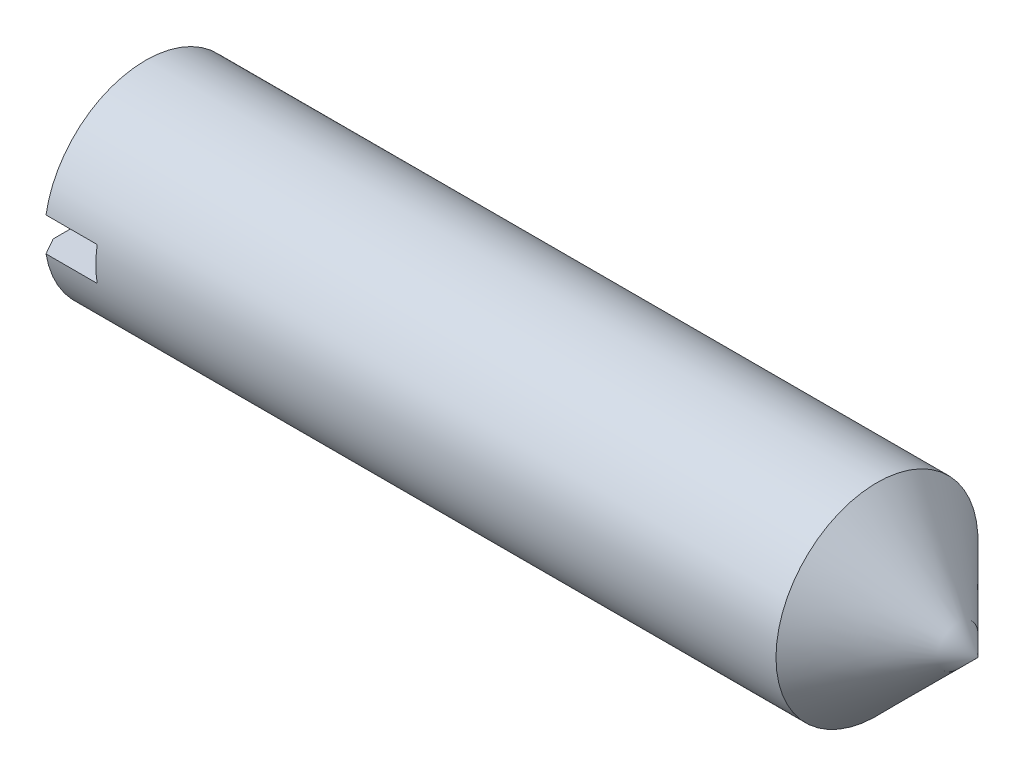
ISO-10303-21;
HEADER;
FILE_DESCRIPTION(('STEP AP214'),'2;1');
FILE_NAME('part.step','',(''),(''),'','','');
FILE_SCHEMA(('AUTOMOTIVE_DESIGN { 1 0 10303 214 1 1 1 1 }'));
ENDSEC;
DATA;
#1=APPLICATION_CONTEXT('core data for automotive mechanical design processes');
#2=APPLICATION_PROTOCOL_DEFINITION('international standard','automotive_design',2000,#1);
#3=PRODUCT_CONTEXT('',#1,'mechanical');
#4=PRODUCT('Part','Part','',(#3));
#5=PRODUCT_RELATED_PRODUCT_CATEGORY('part','',(#4));
#6=PRODUCT_DEFINITION_FORMATION('','',#4);
#7=PRODUCT_DEFINITION_CONTEXT('part definition',#1,'design');
#8=PRODUCT_DEFINITION('design','',#6,#7);
#9=PRODUCT_DEFINITION_SHAPE('','',#8);
#10=(LENGTH_UNIT() NAMED_UNIT(*) SI_UNIT(.MILLI.,.METRE.));
#11=(NAMED_UNIT(*) PLANE_ANGLE_UNIT() SI_UNIT($,.RADIAN.));
#12=(NAMED_UNIT(*) SI_UNIT($,.STERADIAN.) SOLID_ANGLE_UNIT());
#13=UNCERTAINTY_MEASURE_WITH_UNIT(LENGTH_MEASURE(1.E-05),#10,'distance_accuracy_value','');
#14=(GEOMETRIC_REPRESENTATION_CONTEXT(3) GLOBAL_UNCERTAINTY_ASSIGNED_CONTEXT((#13)) GLOBAL_UNIT_ASSIGNED_CONTEXT((#10,
#11,#12)) REPRESENTATION_CONTEXT('',''));
#15=CARTESIAN_POINT('',(0.,0.,0.));
#16=DIRECTION('',(0.,0.,1.));
#17=DIRECTION('',(1.,0.,0.));
#18=AXIS2_PLACEMENT_3D('',#15,#16,#17);
#19=CARTESIAN_POINT('',(0.,0.,0.));
#20=DIRECTION('',(-1.,0.,0.));
#21=DIRECTION('',(0.,0.,1.));
#22=AXIS2_PLACEMENT_3D('',#19,#20,#21);
#23=PLANE('',#22);
#24=CARTESIAN_POINT('',(0.,0.,0.));
#25=DIRECTION('',(-1.,0.,0.));
#26=DIRECTION('',(0.,0.,1.));
#27=AXIS2_PLACEMENT_3D('',#24,#25,#26);
#28=CIRCLE('',#27,5.036);
#29=CARTESIAN_POINT('',(0.,-1.,-4.93571636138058));
#30=VERTEX_POINT('',#29);
#31=CARTESIAN_POINT('',(0.,-0.999999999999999,4.93571636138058));
#32=VERTEX_POINT('',#31);
#33=EDGE_CURVE('E159',#30,#32,#28,.T.);
#34=ORIENTED_EDGE('',*,*,#33,.T.);
#35=DIRECTION('',(0.,0.,-1.));
#36=VECTOR('',#35,1.);
#37=CARTESIAN_POINT('',(0.,-0.999999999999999,6.));
#38=LINE('',#37,#36);
#39=EDGE_CURVE('E115',#32,#30,#38,.T.);
#40=ORIENTED_EDGE('',*,*,#39,.T.);
#41=EDGE_LOOP('',(#34,#40));
#42=FACE_BOUND('',#41,.T.);
#43=ADVANCED_FACE('F36',(#42),#23,.T.);
#44=CARTESIAN_POINT('',(0.,0.,0.));
#45=DIRECTION('',(1.,0.,0.));
#46=DIRECTION('',(0.,0.,-1.));
#47=AXIS2_PLACEMENT_3D('',#44,#45,#46);
#48=CONICAL_SURFACE('',#47,5.036,1.04719755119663);
#49=CARTESIAN_POINT('',(0.556565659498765,0.,0.));
#50=DIRECTION('',(-1.,0.,0.));
#51=DIRECTION('',(0.,0.,1.));
#52=AXIS2_PLACEMENT_3D('',#49,#50,#51);
#53=CIRCLE('',#52,6.);
#54=CARTESIAN_POINT('',(0.556565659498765,-1.,-5.91607978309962));
#55=VERTEX_POINT('',#54);
#56=CARTESIAN_POINT('',(0.556565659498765,-0.999999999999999,5.91607978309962));
#57=VERTEX_POINT('',#56);
#58=EDGE_CURVE('E164',#55,#57,#53,.T.);
#59=ORIENTED_EDGE('',*,*,#58,.T.);
#60=CARTESIAN_POINT('',(4.73989669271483,-0.999999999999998,13.2079399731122));
#61=CARTESIAN_POINT('',(4.41853771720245,-0.999999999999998,12.649708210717));
#62=CARTESIAN_POINT('',(4.09724308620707,-0.999999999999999,12.0914392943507));
#63=CARTESIAN_POINT('',(3.4549186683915,-0.999999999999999,10.9747439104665));
#64=CARTESIAN_POINT('',(3.13388888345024,-0.999999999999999,10.4163174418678));
#65=CARTESIAN_POINT('',(2.49197762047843,-0.999999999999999,9.2987837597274));
#66=CARTESIAN_POINT('',(2.17109646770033,-0.999999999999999,8.73967635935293));
#67=CARTESIAN_POINT('',(1.53002759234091,-0.999999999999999,7.62106803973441));
#68=CARTESIAN_POINT('',(1.20983986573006,-0.999999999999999,7.06156712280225));
#69=CARTESIAN_POINT('',(0.731752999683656,-0.999999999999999,6.2237447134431));
#70=CARTESIAN_POINT('',(0.573331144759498,-0.999999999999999,5.94572157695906));
#71=CARTESIAN_POINT('',(0.257006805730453,-0.999999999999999,5.38937510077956));
#72=CARTESIAN_POINT('',(0.0991043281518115,-0.999999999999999,5.11105175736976));
#73=CARTESIAN_POINT('',(-0.215803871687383,-0.999999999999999,4.55405780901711));
#74=CARTESIAN_POINT('',(-0.372809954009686,-0.999999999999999,4.27538740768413));
#75=CARTESIAN_POINT('',(-0.68542141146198,-0.999999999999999,3.71727146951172));
#76=CARTESIAN_POINT('',(-0.841026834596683,-1.,3.43782595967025));
#77=CARTESIAN_POINT('',(-1.07280047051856,-1.,3.01670739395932));
#78=CARTESIAN_POINT('',(-1.15000341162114,-1.,2.8756048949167));
#79=CARTESIAN_POINT('',(-1.30334590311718,-1.,2.59280771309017));
#80=CARTESIAN_POINT('',(-1.37948536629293,-1.,2.45111298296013));
#81=CARTESIAN_POINT('',(-1.53019389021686,-1.,2.16666998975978));
#82=CARTESIAN_POINT('',(-1.60476099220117,-0.999999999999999,2.02392068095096));
#83=CARTESIAN_POINT('',(-1.71445658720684,-1.,1.80870871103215));
#84=CARTESIAN_POINT('',(-1.75066016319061,-1.,1.73679509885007));
#85=CARTESIAN_POINT('',(-1.82208482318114,-1.,1.59248261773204));
#86=CARTESIAN_POINT('',(-1.85730593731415,-1.,1.52008376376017));
#87=CARTESIAN_POINT('',(-1.92735529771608,-1.,1.3726146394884));
#88=CARTESIAN_POINT('',(-1.96214530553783,-1.,1.29752611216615));
#89=CARTESIAN_POINT('',(-2.02965956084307,-1.,1.14642727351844));
#90=CARTESIAN_POINT('',(-2.06238404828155,-1.,1.07041707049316));
#91=CARTESIAN_POINT('',(-2.12476431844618,-1.,0.917145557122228));
#92=CARTESIAN_POINT('',(-2.1544205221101,-1.,0.839884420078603));
#93=CARTESIAN_POINT('',(-2.20906255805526,-1.,0.683706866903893));
#94=CARTESIAN_POINT('',(-2.23405029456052,-1.,0.60479114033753));
#95=CARTESIAN_POINT('',(-2.27018581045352,-1.,0.470093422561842));
#96=CARTESIAN_POINT('',(-2.28321589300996,-1.,0.414824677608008));
#97=CARTESIAN_POINT('',(-2.3049462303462,-1.,0.303453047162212));
#98=CARTESIAN_POINT('',(-2.31364920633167,-1.,0.247350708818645));
#99=CARTESIAN_POINT('',(-2.32581520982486,-1.,0.134957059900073));
#100=CARTESIAN_POINT('',(-2.32931440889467,-1.,0.0786698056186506));
#101=CARTESIAN_POINT('',(-2.33076867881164,-1.,-0.0339758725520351));
#102=CARTESIAN_POINT('',(-2.32872385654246,-1.,-0.0903342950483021));
#103=CARTESIAN_POINT('',(-2.3180579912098,-1.,-0.217768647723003));
#104=CARTESIAN_POINT('',(-2.3078092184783,-1.,-0.288706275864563));
#105=CARTESIAN_POINT('',(-2.280414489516,-1.,-0.429255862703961));
#106=CARTESIAN_POINT('',(-2.2632604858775,-1.,-0.498866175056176));
#107=CARTESIAN_POINT('',(-2.23367324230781,-1.,-0.602653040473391));
#108=CARTESIAN_POINT('',(-2.22308279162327,-1.,-0.637377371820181));
#109=CARTESIAN_POINT('',(-2.20083833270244,-1.,-0.70646098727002));
#110=CARTESIAN_POINT('',(-2.18918499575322,-1.,-0.740820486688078));
#111=CARTESIAN_POINT('',(-2.16499431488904,-1.,-0.809218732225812));
#112=CARTESIAN_POINT('',(-2.15245710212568,-1.,-0.843257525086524));
#113=CARTESIAN_POINT('',(-2.12664333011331,-1.,-0.911058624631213));
#114=CARTESIAN_POINT('',(-2.11336665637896,-1.,-0.944820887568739));
#115=CARTESIAN_POINT('',(-2.06998388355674,-1.,-1.05227293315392));
#116=CARTESIAN_POINT('',(-2.03871498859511,-1.,-1.12549298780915));
#117=CARTESIAN_POINT('',(-1.97418773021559,-1.,-1.27105481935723));
#118=CARTESIAN_POINT('',(-1.94092900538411,-1.,-1.34339643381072));
#119=CARTESIAN_POINT('',(-1.87300145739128,-1.,-1.48745172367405));
#120=CARTESIAN_POINT('',(-1.83833201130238,-1.,-1.55916510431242));
#121=CARTESIAN_POINT('',(-1.76798292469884,-1.,-1.70209571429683));
#122=CARTESIAN_POINT('',(-1.73230324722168,-1.,-1.77331292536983));
#123=CARTESIAN_POINT('',(-1.62404833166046,-1.,-1.98662313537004));
#124=CARTESIAN_POINT('',(-1.55036430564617,-1.,-2.1281523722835));
#125=CARTESIAN_POINT('',(-1.401308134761,-1.,-2.41025810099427));
#126=CARTESIAN_POINT('',(-1.32593649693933,-1.,-2.55083486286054));
#127=CARTESIAN_POINT('',(-1.17450983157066,-1.,-2.83063597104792));
#128=CARTESIAN_POINT('',(-1.09846071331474,-1.,-2.96986351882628));
#129=CARTESIAN_POINT('',(-0.945628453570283,-1.,-3.24792809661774));
#130=CARTESIAN_POINT('',(-0.868845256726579,-1.,-3.38676509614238));
#131=CARTESIAN_POINT('',(-0.637891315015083,-1.,-3.80258527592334));
#132=CARTESIAN_POINT('',(-0.48296758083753,-1.,-4.07914988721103));
#133=CARTESIAN_POINT('',(-0.119566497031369,-1.,-4.72494312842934));
#134=CARTESIAN_POINT('',(0.0893330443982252,-1.,-5.09393352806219));
#135=CARTESIAN_POINT('',(0.50813116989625,-1.,-5.83135176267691));
#136=CARTESIAN_POINT('',(0.718029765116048,-1.,-6.19977959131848));
#137=CARTESIAN_POINT('',(1.13850339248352,-1.,-6.93645171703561));
#138=CARTESIAN_POINT('',(1.34907866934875,-1.,-7.30469587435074));
#139=CARTESIAN_POINT('',(1.77060223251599,-1.,-8.04096877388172));
#140=CARTESIAN_POINT('',(1.98155051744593,-1.,-8.40899751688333));
#141=CARTESIAN_POINT('',(2.40459995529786,-1.,-9.14648067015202));
#142=CARTESIAN_POINT('',(2.61670218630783,-1.,-9.51593446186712));
#143=CARTESIAN_POINT('',(3.04108596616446,-1.,-10.2547396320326));
#144=CARTESIAN_POINT('',(3.2533675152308,-1.,-10.6240910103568));
#145=CARTESIAN_POINT('',(3.67796813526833,-1.,-11.3625576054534));
#146=CARTESIAN_POINT('',(3.89028714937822,-1.,-11.7316728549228));
#147=CARTESIAN_POINT('',(4.31502474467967,-1.,-12.469845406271));
#148=CARTESIAN_POINT('',(4.52744332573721,-1.,-12.8389027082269));
#149=CARTESIAN_POINT('',(4.73989669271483,-1.,-13.2079399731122));
#150=B_SPLINE_CURVE_WITH_KNOTS('',3,(#60,#61,#62,#63,#64,#65,#66,#67,#68,#69,#70,#71,#72,#73,
#74,#75,#76,#77,#78,#79,#80,#81,#82,#83,#84,#85,#86,#87,#88,#89,#90,#91,#92,#93,#94,#95,#96,#97,
#98,#99,#100,#101,#102,#103,#104,#105,#106,#107,#108,#109,#110,#111,#112,#113,#114,#115,#116,
#117,#118,#119,#120,#121,#122,#123,#124,#125,#126,#127,#128,#129,#130,#131,#132,#133,#134,#135,
#136,#137,#138,#139,#140,#141,#142,#143,#144,#145,#146,#147,#148,#149),.UNSPECIFIED.,.F.,.F.,(4,
2,2,2,2,2,2,2,2,2,2,2,2,2,2,2,2,2,2,2,2,2,2,2,2,2,2,2,2,2,2,2,2,2,2,2,2,2,2,2,2,2,2,2,4),(0.,
1.93236881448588,3.86475122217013,5.79868288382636,7.73260327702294,8.69257649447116,
9.65256172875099,10.6121295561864,11.5716643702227,12.0541876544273,12.5367502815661,
13.0198822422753,13.2614145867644,13.5029395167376,13.7511887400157,13.9994090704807,
14.247595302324,14.4956800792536,14.6658994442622,14.8360116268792,15.004935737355,
15.1738565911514,15.3884236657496,15.6032415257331,15.7121389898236,15.8209681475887,
15.9297811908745,16.0386111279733,16.2774120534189,16.5162564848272,16.7552075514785,
16.9941673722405,17.4728272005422,17.9513450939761,18.4272722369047,18.9032355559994,
19.8542316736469,21.1262890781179,22.3983607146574,23.6709606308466,24.9435558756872,
26.2215820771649,27.4996098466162,28.7770795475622,30.0545475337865),.UNSPECIFIED.);
#151=EDGE_CURVE('E106',#57,#32,#150,.T.);
#152=ORIENTED_EDGE('',*,*,#151,.T.);
#153=ORIENTED_EDGE('',*,*,#33,.F.);
#154=EDGE_CURVE('E169',#30,#55,#150,.T.);
#155=ORIENTED_EDGE('',*,*,#154,.T.);
#156=EDGE_LOOP('',(#59,#152,#153,#155));
#157=FACE_BOUND('',#156,.T.);
#158=ADVANCED_FACE('F144',(#157),#48,.T.);
#159=CARTESIAN_POINT('',(-12.7,0.,0.));
#160=DIRECTION('',(-1.,0.,0.));
#161=DIRECTION('',(0.,0.,1.));
#162=AXIS2_PLACEMENT_3D('',#159,#160,#161);
#163=CYLINDRICAL_SURFACE('',#162,6.);
#164=CARTESIAN_POINT('',(44.,0.,0.));
#165=DIRECTION('',(-1.,0.,0.));
#166=DIRECTION('',(0.,0.,1.));
#167=AXIS2_PLACEMENT_3D('',#164,#165,#166);
#168=CIRCLE('',#167,6.);
#169=CARTESIAN_POINT('',(44.,0.,6.));
#170=VERTEX_POINT('',#169);
#171=EDGE_CURVE('E168',#170,#170,#168,.T.);
#172=ORIENTED_EDGE('',*,*,#171,.T.);
#173=EDGE_LOOP('',(#172));
#174=FACE_BOUND('',#173,.T.);
#175=ORIENTED_EDGE('',*,*,#58,.F.);
#176=DIRECTION('',(-1.,0.,0.));
#177=VECTOR('',#176,1.);
#178=CARTESIAN_POINT('',(-12.7,-1.,-5.91607978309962));
#179=LINE('',#178,#177);
#180=CARTESIAN_POINT('',(3.6,-1.,-5.91607978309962));
#181=VERTEX_POINT('',#180);
#182=EDGE_CURVE('E12',#55,#181,#179,.F.);
#183=ORIENTED_EDGE('',*,*,#182,.T.);
#184=CARTESIAN_POINT('',(3.6,0.,0.));
#185=DIRECTION('',(-1.,0.,0.));
#186=DIRECTION('',(0.,0.,1.));
#187=AXIS2_PLACEMENT_3D('',#184,#185,#186);
#188=CIRCLE('',#187,6.);
#189=CARTESIAN_POINT('',(3.6,1.,-5.91607978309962));
#190=VERTEX_POINT('',#189);
#191=EDGE_CURVE('E102',#181,#190,#188,.F.);
#192=ORIENTED_EDGE('',*,*,#191,.T.);
#193=DIRECTION('',(-1.,0.,0.));
#194=VECTOR('',#193,1.);
#195=CARTESIAN_POINT('',(-12.7,1.,-5.91607978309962));
#196=LINE('',#195,#194);
#197=CARTESIAN_POINT('',(0.556565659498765,1.,-5.91607978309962));
#198=VERTEX_POINT('',#197);
#199=EDGE_CURVE('E44',#198,#190,#196,.F.);
#200=ORIENTED_EDGE('',*,*,#199,.F.);
#201=CARTESIAN_POINT('',(0.556565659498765,1.,5.91607978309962));
#202=VERTEX_POINT('',#201);
#203=EDGE_CURVE('E160',#202,#198,#53,.T.);
#204=ORIENTED_EDGE('',*,*,#203,.F.);
#205=DIRECTION('',(-1.,0.,0.));
#206=VECTOR('',#205,1.);
#207=CARTESIAN_POINT('',(-12.7,1.,5.91607978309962));
#208=LINE('',#207,#206);
#209=CARTESIAN_POINT('',(3.6,1.,5.91607978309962));
#210=VERTEX_POINT('',#209);
#211=EDGE_CURVE('E95',#210,#202,#208,.T.);
#212=ORIENTED_EDGE('',*,*,#211,.F.);
#213=CARTESIAN_POINT('',(3.6,-0.999999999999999,5.91607978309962));
#214=VERTEX_POINT('',#213);
#215=EDGE_CURVE('E88',#210,#214,#188,.F.);
#216=ORIENTED_EDGE('',*,*,#215,.T.);
#217=DIRECTION('',(-1.,0.,0.));
#218=VECTOR('',#217,1.);
#219=CARTESIAN_POINT('',(-12.7,-0.999999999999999,5.91607978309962));
#220=LINE('',#219,#218);
#221=EDGE_CURVE('E92',#214,#57,#220,.T.);
#222=ORIENTED_EDGE('',*,*,#221,.T.);
#223=EDGE_LOOP('',(#175,#183,#192,#200,#204,#212,#216,#222));
#224=FACE_BOUND('',#223,.T.);
#225=ADVANCED_FACE('F91',(#174,#224),#163,.T.);
#226=DIRECTION('',(0.,0.,-1.));
#227=VECTOR('',#226,1.);
#228=CARTESIAN_POINT('',(0.,1.,6.));
#229=LINE('',#228,#227);
#230=CARTESIAN_POINT('',(0.,1.,4.93571636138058));
#231=VERTEX_POINT('',#230);
#232=CARTESIAN_POINT('',(0.,1.,-4.93571636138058));
#233=VERTEX_POINT('',#232);
#234=EDGE_CURVE('E118',#231,#233,#229,.T.);
#235=ORIENTED_EDGE('',*,*,#234,.F.);
#236=EDGE_CURVE('E100',#231,#233,#28,.T.);
#237=ORIENTED_EDGE('',*,*,#236,.T.);
#238=EDGE_LOOP('',(#235,#237));
#239=FACE_BOUND('',#238,.T.);
#240=ADVANCED_FACE('F38',(#239),#23,.T.);
#241=CARTESIAN_POINT('',(4.73989669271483,1.,13.2079399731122));
#242=CARTESIAN_POINT('',(4.41853771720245,1.,12.649708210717));
#243=CARTESIAN_POINT('',(4.09724308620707,1.,12.0914392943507));
#244=CARTESIAN_POINT('',(3.4549186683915,1.,10.9747439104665));
#245=CARTESIAN_POINT('',(3.13388888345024,1.,10.4163174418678));
#246=CARTESIAN_POINT('',(2.49197762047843,1.,9.2987837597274));
#247=CARTESIAN_POINT('',(2.17109646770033,1.,8.73967635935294));
#248=CARTESIAN_POINT('',(1.53002759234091,1.,7.62106803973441));
#249=CARTESIAN_POINT('',(1.20983986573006,1.,7.06156712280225));
#250=CARTESIAN_POINT('',(0.731752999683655,1.,6.2237447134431));
#251=CARTESIAN_POINT('',(0.573331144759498,1.,5.94572157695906));
#252=CARTESIAN_POINT('',(0.257006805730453,1.,5.38937510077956));
#253=CARTESIAN_POINT('',(0.0991043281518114,1.,5.11105175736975));
#254=CARTESIAN_POINT('',(-0.215803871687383,1.,4.55405780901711));
#255=CARTESIAN_POINT('',(-0.372809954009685,1.,4.27538740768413));
#256=CARTESIAN_POINT('',(-0.685421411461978,1.,3.71727146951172));
#257=CARTESIAN_POINT('',(-0.841026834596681,1.,3.43782595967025));
#258=CARTESIAN_POINT('',(-1.07280047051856,1.,3.01670739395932));
#259=CARTESIAN_POINT('',(-1.15000341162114,1.,2.87560489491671));
#260=CARTESIAN_POINT('',(-1.30334590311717,1.,2.59280771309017));
#261=CARTESIAN_POINT('',(-1.37948536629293,1.,2.45111298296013));
#262=CARTESIAN_POINT('',(-1.53019389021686,1.,2.16666998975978));
#263=CARTESIAN_POINT('',(-1.60476099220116,1.,2.02392068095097));
#264=CARTESIAN_POINT('',(-1.71445658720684,1.,1.80870871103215));
#265=CARTESIAN_POINT('',(-1.75066016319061,1.,1.73679509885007));
#266=CARTESIAN_POINT('',(-1.82208482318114,1.,1.59248261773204));
#267=CARTESIAN_POINT('',(-1.85730593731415,1.,1.52008376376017));
#268=CARTESIAN_POINT('',(-1.92735529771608,1.,1.3726146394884));
#269=CARTESIAN_POINT('',(-1.96214530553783,1.,1.29752611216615));
#270=CARTESIAN_POINT('',(-2.02965956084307,1.,1.14642727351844));
#271=CARTESIAN_POINT('',(-2.06238404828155,1.,1.07041707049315));
#272=CARTESIAN_POINT('',(-2.12476431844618,1.,0.917145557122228));
#273=CARTESIAN_POINT('',(-2.1544205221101,1.,0.839884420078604));
#274=CARTESIAN_POINT('',(-2.20906255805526,1.,0.683706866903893));
#275=CARTESIAN_POINT('',(-2.23405029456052,1.,0.60479114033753));
#276=CARTESIAN_POINT('',(-2.27018581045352,1.,0.470093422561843));
#277=CARTESIAN_POINT('',(-2.28321589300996,1.,0.414824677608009));
#278=CARTESIAN_POINT('',(-2.3049462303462,1.,0.303453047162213));
#279=CARTESIAN_POINT('',(-2.31364920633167,1.,0.247350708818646));
#280=CARTESIAN_POINT('',(-2.32581520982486,1.,0.134957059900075));
#281=CARTESIAN_POINT('',(-2.32931440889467,1.,0.078669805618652));
#282=CARTESIAN_POINT('',(-2.33076867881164,1.,-0.0339758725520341));
#283=CARTESIAN_POINT('',(-2.32872385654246,1.,-0.0903342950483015));
#284=CARTESIAN_POINT('',(-2.3180579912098,1.,-0.217768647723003));
#285=CARTESIAN_POINT('',(-2.3078092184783,1.,-0.288706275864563));
#286=CARTESIAN_POINT('',(-2.280414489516,1.,-0.429255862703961));
#287=CARTESIAN_POINT('',(-2.2632604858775,1.,-0.498866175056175));
#288=CARTESIAN_POINT('',(-2.23367324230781,1.,-0.602653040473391));
#289=CARTESIAN_POINT('',(-2.22308279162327,1.,-0.637377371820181));
#290=CARTESIAN_POINT('',(-2.20083833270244,1.,-0.70646098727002));
#291=CARTESIAN_POINT('',(-2.18918499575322,1.,-0.740820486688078));
#292=CARTESIAN_POINT('',(-2.16499431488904,1.,-0.809218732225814));
#293=CARTESIAN_POINT('',(-2.15245710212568,1.,-0.843257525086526));
#294=CARTESIAN_POINT('',(-2.12664333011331,1.,-0.911058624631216));
#295=CARTESIAN_POINT('',(-2.11336665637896,1.,-0.94482088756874));
#296=CARTESIAN_POINT('',(-2.06998388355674,1.,-1.05227293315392));
#297=CARTESIAN_POINT('',(-2.03871498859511,1.,-1.12549298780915));
#298=CARTESIAN_POINT('',(-1.97418773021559,1.,-1.27105481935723));
#299=CARTESIAN_POINT('',(-1.94092900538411,1.,-1.34339643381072));
#300=CARTESIAN_POINT('',(-1.87300145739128,1.,-1.48745172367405));
#301=CARTESIAN_POINT('',(-1.83833201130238,1.,-1.55916510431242));
#302=CARTESIAN_POINT('',(-1.76798292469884,1.,-1.70209571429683));
#303=CARTESIAN_POINT('',(-1.73230324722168,1.,-1.77331292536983));
#304=CARTESIAN_POINT('',(-1.62404833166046,1.,-1.98662313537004));
#305=CARTESIAN_POINT('',(-1.55036430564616,1.,-2.12815237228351));
#306=CARTESIAN_POINT('',(-1.401308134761,1.,-2.41025810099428));
#307=CARTESIAN_POINT('',(-1.32593649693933,1.,-2.55083486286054));
#308=CARTESIAN_POINT('',(-1.17450983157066,1.,-2.83063597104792));
#309=CARTESIAN_POINT('',(-1.09846071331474,1.,-2.96986351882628));
#310=CARTESIAN_POINT('',(-0.945628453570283,1.,-3.24792809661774));
#311=CARTESIAN_POINT('',(-0.868845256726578,1.,-3.38676509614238));
#312=CARTESIAN_POINT('',(-0.637891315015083,1.,-3.80258527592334));
#313=CARTESIAN_POINT('',(-0.482967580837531,1.,-4.07914988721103));
#314=CARTESIAN_POINT('',(-0.11956649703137,1.,-4.72494312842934));
#315=CARTESIAN_POINT('',(0.0893330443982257,1.,-5.09393352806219));
#316=CARTESIAN_POINT('',(0.508131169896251,1.,-5.83135176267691));
#317=CARTESIAN_POINT('',(0.718029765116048,1.,-6.19977959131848));
#318=CARTESIAN_POINT('',(1.13850339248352,1.,-6.93645171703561));
#319=CARTESIAN_POINT('',(1.34907866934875,0.999999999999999,-7.30469587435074));
#320=CARTESIAN_POINT('',(1.77060223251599,0.999999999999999,-8.04096877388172));
#321=CARTESIAN_POINT('',(1.98155051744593,0.999999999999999,-8.40899751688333));
#322=CARTESIAN_POINT('',(2.40459995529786,0.999999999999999,-9.14648067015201));
#323=CARTESIAN_POINT('',(2.61670218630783,0.999999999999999,-9.51593446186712));
#324=CARTESIAN_POINT('',(3.04108596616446,0.999999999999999,-10.2547396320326));
#325=CARTESIAN_POINT('',(3.2533675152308,0.999999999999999,-10.6240910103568));
#326=CARTESIAN_POINT('',(3.67796813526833,0.999999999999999,-11.3625576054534));
#327=CARTESIAN_POINT('',(3.89028714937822,0.999999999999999,-11.7316728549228));
#328=CARTESIAN_POINT('',(4.31502474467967,0.999999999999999,-12.469845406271));
#329=CARTESIAN_POINT('',(4.52744332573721,0.999999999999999,-12.8389027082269));
#330=CARTESIAN_POINT('',(4.73989669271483,0.999999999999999,-13.2079399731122));
#331=B_SPLINE_CURVE_WITH_KNOTS('',3,(#241,#242,#243,#244,#245,#246,#247,#248,#249,#250,#251,
#252,#253,#254,#255,#256,#257,#258,#259,#260,#261,#262,#263,#264,#265,#266,#267,#268,#269,#270,
#271,#272,#273,#274,#275,#276,#277,#278,#279,#280,#281,#282,#283,#284,#285,#286,#287,#288,#289,
#290,#291,#292,#293,#294,#295,#296,#297,#298,#299,#300,#301,#302,#303,#304,#305,#306,#307,#308,
#309,#310,#311,#312,#313,#314,#315,#316,#317,#318,#319,#320,#321,#322,#323,#324,#325,#326,#327,
#328,#329,#330),.UNSPECIFIED.,.F.,.F.,(4,2,2,2,2,2,2,2,2,2,2,2,2,2,2,2,2,2,2,2,2,2,2,2,2,2,2,2,
2,2,2,2,2,2,2,2,2,2,2,2,2,2,2,2,4),(0.,1.93236881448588,3.86475122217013,5.79868288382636,
7.73260327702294,8.69257649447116,9.65256172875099,10.6121295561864,11.5716643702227,
12.0541876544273,12.5367502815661,13.0198822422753,13.2614145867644,13.5029395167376,
13.7511887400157,13.9994090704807,14.247595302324,14.4956800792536,14.6658994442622,
14.8360116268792,15.004935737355,15.1738565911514,15.3884236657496,15.6032415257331,
15.7121389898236,15.8209681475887,15.9297811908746,16.0386111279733,16.2774120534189,
16.5162564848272,16.7552075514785,16.9941673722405,17.4728272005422,17.9513450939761,
18.4272722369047,18.9032355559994,19.8542316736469,21.1262890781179,22.3983607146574,
23.6709606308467,24.9435558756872,26.2215820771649,27.4996098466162,28.7770795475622,
30.0545475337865),.UNSPECIFIED.);
#332=EDGE_CURVE('E110',#202,#231,#331,.T.);
#333=ORIENTED_EDGE('',*,*,#332,.F.);
#334=ORIENTED_EDGE('',*,*,#203,.T.);
#335=EDGE_CURVE('E113',#233,#198,#331,.T.);
#336=ORIENTED_EDGE('',*,*,#335,.F.);
#337=ORIENTED_EDGE('',*,*,#236,.F.);
#338=EDGE_LOOP('',(#333,#334,#336,#337));
#339=FACE_BOUND('',#338,.T.);
#340=ADVANCED_FACE('F131',(#339),#48,.T.);
#341=CARTESIAN_POINT('',(44.,0.,0.));
#342=DIRECTION('',(-1.,0.,0.));
#343=DIRECTION('',(0.,0.,1.));
#344=AXIS2_PLACEMENT_3D('',#341,#342,#343);
#345=CONICAL_SURFACE('',#344,6.,0.785398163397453);
#346=CARTESIAN_POINT('',(50.,0.,0.));
#347=VERTEX_POINT('',#346);
#348=VERTEX_LOOP('',#347);
#349=FACE_BOUND('',#348,.T.);
#350=ORIENTED_EDGE('',*,*,#171,.F.);
#351=EDGE_LOOP('',(#350));
#352=FACE_BOUND('',#351,.T.);
#353=ADVANCED_FACE('F141',(#349,#352),#345,.T.);
#354=CARTESIAN_POINT('',(3.6,-0.999999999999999,6.));
#355=DIRECTION('',(0.,1.,0.));
#356=DIRECTION('',(0.,0.,1.));
#357=AXIS2_PLACEMENT_3D('',#354,#355,#356);
#358=PLANE('',#357);
#359=ORIENTED_EDGE('',*,*,#39,.F.);
#360=ORIENTED_EDGE('',*,*,#151,.F.);
#361=ORIENTED_EDGE('',*,*,#221,.F.);
#362=DIRECTION('',(0.,0.,-1.));
#363=VECTOR('',#362,1.);
#364=CARTESIAN_POINT('',(3.6,-0.999999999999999,6.));
#365=LINE('',#364,#363);
#366=EDGE_CURVE('E104',#214,#181,#365,.T.);
#367=ORIENTED_EDGE('',*,*,#366,.T.);
#368=ORIENTED_EDGE('',*,*,#182,.F.);
#369=ORIENTED_EDGE('',*,*,#154,.F.);
#370=EDGE_LOOP('',(#359,#360,#361,#367,#368,#369));
#371=FACE_BOUND('',#370,.T.);
#372=ADVANCED_FACE('F103',(#371),#358,.T.);
#373=CARTESIAN_POINT('',(3.6,1.,6.));
#374=DIRECTION('',(0.,1.,0.));
#375=DIRECTION('',(0.,0.,1.));
#376=AXIS2_PLACEMENT_3D('',#373,#374,#375);
#377=PLANE('',#376);
#378=ORIENTED_EDGE('',*,*,#335,.T.);
#379=ORIENTED_EDGE('',*,*,#199,.T.);
#380=DIRECTION('',(0.,0.,-1.));
#381=VECTOR('',#380,1.);
#382=CARTESIAN_POINT('',(3.6,1.,6.));
#383=LINE('',#382,#381);
#384=EDGE_CURVE('E111',#210,#190,#383,.T.);
#385=ORIENTED_EDGE('',*,*,#384,.F.);
#386=ORIENTED_EDGE('',*,*,#211,.T.);
#387=ORIENTED_EDGE('',*,*,#332,.T.);
#388=ORIENTED_EDGE('',*,*,#234,.T.);
#389=EDGE_LOOP('',(#378,#379,#385,#386,#387,#388));
#390=FACE_BOUND('',#389,.T.);
#391=ADVANCED_FACE('F134',(#390),#377,.F.);
#392=CARTESIAN_POINT('',(3.6,1.,6.));
#393=DIRECTION('',(-1.,0.,0.));
#394=DIRECTION('',(0.,0.,1.));
#395=AXIS2_PLACEMENT_3D('',#392,#393,#394);
#396=PLANE('',#395);
#397=ORIENTED_EDGE('',*,*,#366,.F.);
#398=ORIENTED_EDGE('',*,*,#215,.F.);
#399=ORIENTED_EDGE('',*,*,#384,.T.);
#400=ORIENTED_EDGE('',*,*,#191,.F.);
#401=EDGE_LOOP('',(#397,#398,#399,#400));
#402=FACE_BOUND('',#401,.T.);
#403=ADVANCED_FACE('F108',(#402),#396,.T.);
#404=CLOSED_SHELL('',(#43,#158,#225,#240,#340,#353,#372,#391,#403));
#405=MANIFOLD_SOLID_BREP('B2',#404);
#406=ADVANCED_BREP_SHAPE_REPRESENTATION('',(#18,#405),#14);
#407=SHAPE_DEFINITION_REPRESENTATION(#9,#406);
ENDSEC;
END-ISO-10303-21;
